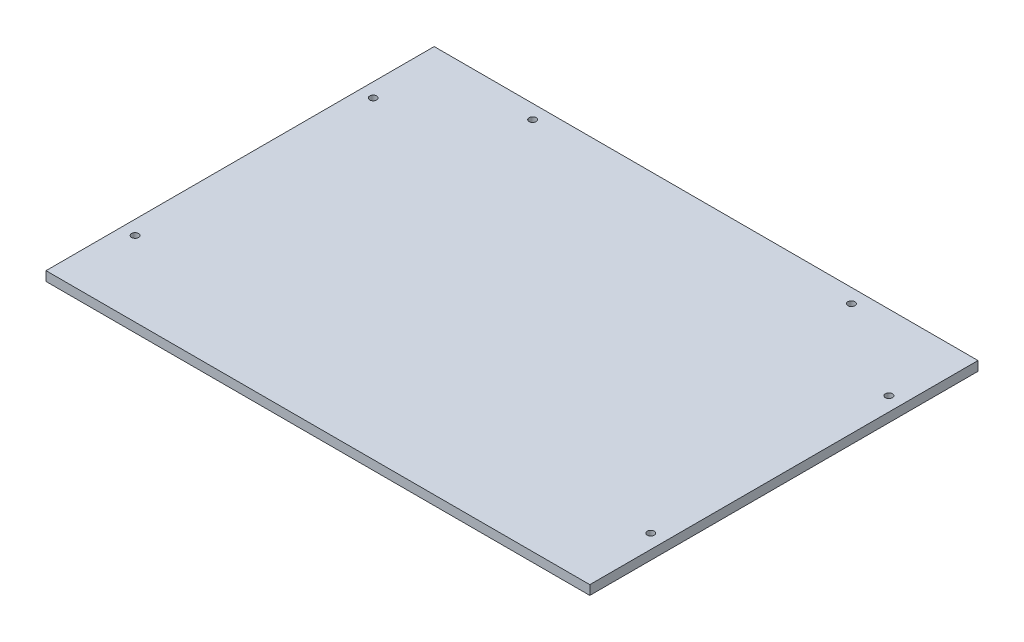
from build123d import *

# Parameters (mm, degrees)
SKETCH1_W               = 736.6
SKETCH1_H               = 525.78
EXTRUDE1_DEPTH          = 12.7
SKETCH2_R               = 4.7625
BARREL_NUTS_SIDES_DEPTH = 906.088646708
SKETCH3_R               = 4.7625
BARREL_NUTS_TOP_DEPTH   = 906.088646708


with BuildPart() as part:
    # Sketch1 → Extrude1 (new body)
    with BuildSketch(Plane(origin=(0, 0, 0), x_dir=(1, 0, 0), z_dir=(0, 1, 0))):
        with Locations((368.3, 262.89)):
            Rectangle(SKETCH1_W, SKETCH1_H)
    extrude(amount=EXTRUDE1_DEPTH)

    # Sketch2 → barrel nuts sides (cut, through all)
    with BuildSketch(Plane(origin=(0, 12.7, 0), x_dir=(1, 0, 0), z_dir=(0, 1, 0))):
        with Locations(Location((19.05, 424.18, 0), (0, 0, 270))):
            Circle(SKETCH2_R)
        with Locations(Location((19.05, 101.6, 0), (0, 0, 270))):
            Circle(SKETCH2_R)
        with Locations(Location((717.55, 101.6, 0), (0, 0, 270))):
            Circle(SKETCH2_R)
        with Locations(Location((717.55, 424.18, 0), (0, 0, 270))):
            Circle(SKETCH2_R)
    extrude(amount=-BARREL_NUTS_SIDES_DEPTH, mode=Mode.SUBTRACT)

    # Sketch3 → barrel nuts top (cut, through all)
    with BuildSketch(Plane(origin=(0, 12.7, 0), x_dir=(1, 0, 0), z_dir=(0, 1, 0))):
        with Locations(Location((152.4, 506.73, 0), (0, 0, 270))):
            Circle(SKETCH3_R)
        with Locations(Location((584.2, 506.73, 0), (0, 0, 270))):
            Circle(SKETCH3_R)
    extrude(amount=-BARREL_NUTS_TOP_DEPTH, mode=Mode.SUBTRACT)


solid = part.part
